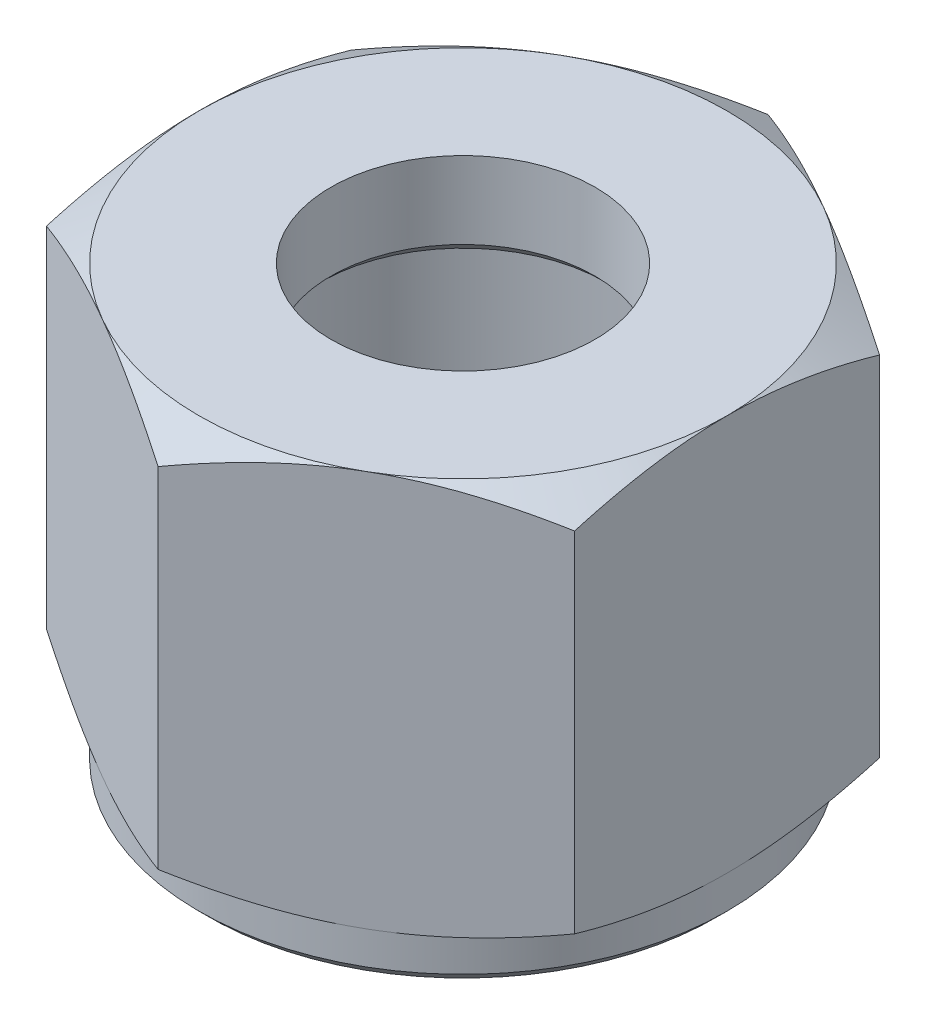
ISO-10303-21;
HEADER;
FILE_DESCRIPTION(('STEP AP214'),'2;1');
FILE_NAME('part.step','',(''),(''),'','','');
FILE_SCHEMA(('AUTOMOTIVE_DESIGN { 1 0 10303 214 1 1 1 1 }'));
ENDSEC;
DATA;
#1=APPLICATION_CONTEXT('core data for automotive mechanical design processes');
#2=APPLICATION_PROTOCOL_DEFINITION('international standard','automotive_design',2000,#1);
#3=PRODUCT_CONTEXT('',#1,'mechanical');
#4=PRODUCT('Part','Part','',(#3));
#5=PRODUCT_RELATED_PRODUCT_CATEGORY('part','',(#4));
#6=PRODUCT_DEFINITION_FORMATION('','',#4);
#7=PRODUCT_DEFINITION_CONTEXT('part definition',#1,'design');
#8=PRODUCT_DEFINITION('design','',#6,#7);
#9=PRODUCT_DEFINITION_SHAPE('','',#8);
#10=(LENGTH_UNIT() NAMED_UNIT(*) SI_UNIT(.MILLI.,.METRE.));
#11=(NAMED_UNIT(*) PLANE_ANGLE_UNIT() SI_UNIT($,.RADIAN.));
#12=(NAMED_UNIT(*) SI_UNIT($,.STERADIAN.) SOLID_ANGLE_UNIT());
#13=UNCERTAINTY_MEASURE_WITH_UNIT(LENGTH_MEASURE(1.E-05),#10,'distance_accuracy_value','');
#14=(GEOMETRIC_REPRESENTATION_CONTEXT(3) GLOBAL_UNCERTAINTY_ASSIGNED_CONTEXT((#13)) GLOBAL_UNIT_ASSIGNED_CONTEXT((#10,
#11,#12)) REPRESENTATION_CONTEXT('',''));
#15=CARTESIAN_POINT('',(0.,0.,0.));
#16=DIRECTION('',(0.,0.,1.));
#17=DIRECTION('',(1.,0.,0.));
#18=AXIS2_PLACEMENT_3D('',#15,#16,#17);
#19=CARTESIAN_POINT('',(12.,18.,-6.92820323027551));
#20=DIRECTION('',(-0.5,0.,0.866025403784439));
#21=DIRECTION('',(0.866025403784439,0.,0.5));
#22=AXIS2_PLACEMENT_3D('',#19,#20,#21);
#23=PLANE('',#22);
#24=CARTESIAN_POINT('',(-0.000199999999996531,1.07186343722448,-13.8565219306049));
#25=CARTESIAN_POINT('',(0.263585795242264,0.983949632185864,-13.7042251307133));
#26=CARTESIAN_POINT('',(0.528355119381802,0.90002599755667,-13.5513604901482));
#27=CARTESIAN_POINT('',(1.06001701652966,0.741266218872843,-13.244405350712));
#28=CARTESIAN_POINT('',(1.32691025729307,0.666433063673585,-13.0903144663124));
#29=CARTESIAN_POINT('',(2.13189040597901,0.457017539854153,-12.6255589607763));
#30=CARTESIAN_POINT('',(2.67315507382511,0.337903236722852,-12.3130596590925));
#31=CARTESIAN_POINT('',(3.483132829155,0.198231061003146,-11.8454187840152));
#32=CARTESIAN_POINT('',(3.74942610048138,0.158443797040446,-11.6916742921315));
#33=CARTESIAN_POINT('',(4.28324559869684,0.0917233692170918,-11.3834734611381));
#34=CARTESIAN_POINT('',(4.55077184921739,0.0647904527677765,-11.2290171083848));
#35=CARTESIAN_POINT('',(5.08627036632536,0.0244685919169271,-10.9198468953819));
#36=CARTESIAN_POINT('',(5.35424172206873,0.0110635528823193,-10.7651335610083));
#37=CARTESIAN_POINT('',(5.89043273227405,-0.00191690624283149,-10.4555635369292));
#38=CARTESIAN_POINT('',(6.15865237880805,-0.00149275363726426,-10.3007068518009));
#39=CARTESIAN_POINT('',(6.66008937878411,0.0122200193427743,-10.0112020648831));
#40=CARTESIAN_POINT('',(6.89334249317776,0.0238359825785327,-9.87653331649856));
#41=CARTESIAN_POINT('',(7.35931224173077,0.0573080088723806,-9.60750555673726));
#42=CARTESIAN_POINT('',(7.59202883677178,0.079164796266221,-9.47314656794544));
#43=CARTESIAN_POINT('',(8.05679907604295,0.132737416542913,-9.2048113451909));
#44=CARTESIAN_POINT('',(8.28885201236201,0.164461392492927,-9.07083551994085));
#45=CARTESIAN_POINT('',(8.75186996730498,0.237211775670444,-8.80351197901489));
#46=CARTESIAN_POINT('',(8.98283491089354,0.278238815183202,-8.67016430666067));
#47=CARTESIAN_POINT('',(9.68394195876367,0.416311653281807,-8.26537996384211));
#48=CARTESIAN_POINT('',(10.1520537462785,0.52712488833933,-7.99511549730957));
#49=CARTESIAN_POINT('',(11.0812971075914,0.778625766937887,-7.45861659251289));
#50=CARTESIAN_POINT('',(11.5424405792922,0.919254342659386,-7.19237528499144));
#51=CARTESIAN_POINT('',(12.0002,1.07186343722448,-6.92808776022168));
#52=B_SPLINE_CURVE_WITH_KNOTS('',3,(#24,#25,#26,#27,#28,#29,#30,#31,#32,#33,#34,#35,#36,#37,#38,
#39,#40,#41,#42,#43,#44,#45,#46,#47,#48,#49,#50,#51),.UNSPECIFIED.,.F.,.F.,(4,2,2,2,2,2,2,2,2,2,
2,2,2,4),(0.,0.951004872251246,1.90232158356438,3.80900466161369,4.73894551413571,
5.6689042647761,6.59775529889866,7.52657763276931,8.33514643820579,9.1437724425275,
9.95306755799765,10.7624176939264,12.4167102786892,14.0677556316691),.UNSPECIFIED.);
#53=CARTESIAN_POINT('',(0.,1.07179676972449,-13.856406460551));
#54=VERTEX_POINT('',#53);
#55=CARTESIAN_POINT('',(6.,0.,-10.3923048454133));
#56=VERTEX_POINT('',#55);
#57=EDGE_CURVE('E140',#54,#56,#52,.T.);
#58=ORIENTED_EDGE('',*,*,#57,.F.);
#59=DIRECTION('',(0.,-1.,0.));
#60=VECTOR('',#59,1.);
#61=CARTESIAN_POINT('',(0.,18.,-13.856406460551));
#62=LINE('',#61,#60);
#63=CARTESIAN_POINT('',(0.,16.9282032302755,-13.856406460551));
#64=VERTEX_POINT('',#63);
#65=EDGE_CURVE('E296',#64,#54,#62,.T.);
#66=ORIENTED_EDGE('',*,*,#65,.F.);
#67=CARTESIAN_POINT('',(12.0002,16.9281365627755,-6.92808776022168));
#68=CARTESIAN_POINT('',(11.7364142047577,17.0160503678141,-7.0803845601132));
#69=CARTESIAN_POINT('',(11.4716448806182,17.0999740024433,-7.23324920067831));
#70=CARTESIAN_POINT('',(10.9399829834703,17.2587337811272,-7.5402043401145));
#71=CARTESIAN_POINT('',(10.6730897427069,17.3335669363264,-7.69429522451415));
#72=CARTESIAN_POINT('',(9.86810959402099,17.5429824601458,-8.15905073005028));
#73=CARTESIAN_POINT('',(9.3268449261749,17.6620967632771,-8.47155003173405));
#74=CARTESIAN_POINT('',(8.51686717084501,17.8017689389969,-8.93919090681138));
#75=CARTESIAN_POINT('',(8.25057389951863,17.8415562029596,-9.09293539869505));
#76=CARTESIAN_POINT('',(7.71675440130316,17.9082766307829,-9.40113622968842));
#77=CARTESIAN_POINT('',(7.44922815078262,17.9352095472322,-9.55559258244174));
#78=CARTESIAN_POINT('',(6.91372963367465,17.9755314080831,-9.86476279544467));
#79=CARTESIAN_POINT('',(6.64575827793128,17.9889364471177,-10.0194761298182));
#80=CARTESIAN_POINT('',(6.10956726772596,18.0019169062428,-10.3290461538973));
#81=CARTESIAN_POINT('',(5.84134762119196,18.0014927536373,-10.4839028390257));
#82=CARTESIAN_POINT('',(5.3399106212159,17.9877799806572,-10.7734076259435));
#83=CARTESIAN_POINT('',(5.10665750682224,17.9761640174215,-10.908076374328));
#84=CARTESIAN_POINT('',(4.64068775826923,17.9426919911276,-11.1771041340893));
#85=CARTESIAN_POINT('',(4.40797116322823,17.9208352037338,-11.3114631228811));
#86=CARTESIAN_POINT('',(3.94320092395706,17.8672625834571,-11.5797983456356));
#87=CARTESIAN_POINT('',(3.711147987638,17.8355386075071,-11.7137741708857));
#88=CARTESIAN_POINT('',(3.24813003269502,17.7627882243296,-11.9810977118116));
#89=CARTESIAN_POINT('',(3.01716508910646,17.7217611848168,-12.1144453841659));
#90=CARTESIAN_POINT('',(2.31605804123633,17.5836883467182,-12.5192297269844));
#91=CARTESIAN_POINT('',(1.84794625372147,17.4728751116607,-12.789494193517));
#92=CARTESIAN_POINT('',(0.918702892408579,17.2213742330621,-13.3259930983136));
#93=CARTESIAN_POINT('',(0.457559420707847,17.0807456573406,-13.5922344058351));
#94=CARTESIAN_POINT('',(-0.000199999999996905,16.9281365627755,-13.8565219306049));
#95=B_SPLINE_CURVE_WITH_KNOTS('',3,(#67,#68,#69,#70,#71,#72,#73,#74,#75,#76,#77,#78,#79,#80,#81,
#82,#83,#84,#85,#86,#87,#88,#89,#90,#91,#92,#93,#94),.UNSPECIFIED.,.F.,.F.,(4,2,2,2,2,2,2,2,2,2,
2,2,2,4),(0.,0.951004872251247,1.90232158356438,3.80900466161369,4.7389455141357,
5.66890426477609,6.59775529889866,7.5265776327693,8.33514643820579,9.1437724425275,
9.95306755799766,10.7624176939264,12.4167102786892,14.0677556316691),.UNSPECIFIED.);
#96=CARTESIAN_POINT('',(6.,18.,-10.3923048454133));
#97=VERTEX_POINT('',#96);
#98=EDGE_CURVE('E571',#97,#64,#95,.T.);
#99=ORIENTED_EDGE('',*,*,#98,.F.);
#100=CARTESIAN_POINT('',(12.,16.9282032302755,-6.92820323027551));
#101=VERTEX_POINT('',#100);
#102=EDGE_CURVE('E568',#101,#97,#95,.T.);
#103=ORIENTED_EDGE('',*,*,#102,.F.);
#104=DIRECTION('',(0.,-1.,0.));
#105=VECTOR('',#104,1.);
#106=CARTESIAN_POINT('',(12.,18.,-6.92820323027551));
#107=LINE('',#106,#105);
#108=CARTESIAN_POINT('',(12.,1.07179676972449,-6.92820323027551));
#109=VERTEX_POINT('',#108);
#110=EDGE_CURVE('E162',#101,#109,#107,.T.);
#111=ORIENTED_EDGE('',*,*,#110,.T.);
#112=EDGE_CURVE('E148',#56,#109,#52,.T.);
#113=ORIENTED_EDGE('',*,*,#112,.F.);
#114=EDGE_LOOP('',(#58,#66,#99,#103,#111,#113));
#115=FACE_BOUND('',#114,.T.);
#116=ADVANCED_FACE('F38',(#115),#23,.F.);
#117=CARTESIAN_POINT('',(0.,18.,-13.856406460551));
#118=DIRECTION('',(0.5,0.,0.866025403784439));
#119=DIRECTION('',(0.866025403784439,0.,-0.5));
#120=AXIS2_PLACEMENT_3D('',#117,#118,#119);
#121=PLANE('',#120);
#122=CARTESIAN_POINT('',(-12.0002,1.07186343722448,-6.92808776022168));
#123=CARTESIAN_POINT('',(-11.7364142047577,0.983949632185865,-7.0803845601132));
#124=CARTESIAN_POINT('',(-11.4716448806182,0.900025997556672,-7.23324920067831));
#125=CARTESIAN_POINT('',(-10.9399829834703,0.741266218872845,-7.5402043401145));
#126=CARTESIAN_POINT('',(-10.6730897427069,0.666433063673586,-7.69429522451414));
#127=CARTESIAN_POINT('',(-9.868109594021,0.457017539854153,-8.15905073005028));
#128=CARTESIAN_POINT('',(-9.3268449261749,0.337903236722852,-8.47155003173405));
#129=CARTESIAN_POINT('',(-8.51686717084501,0.198231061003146,-8.93919090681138));
#130=CARTESIAN_POINT('',(-8.25057389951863,0.158443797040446,-9.09293539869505));
#131=CARTESIAN_POINT('',(-7.71675440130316,0.0917233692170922,-9.40113622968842));
#132=CARTESIAN_POINT('',(-7.44922815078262,0.0647904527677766,-9.55559258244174));
#133=CARTESIAN_POINT('',(-6.91372963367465,0.024468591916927,-9.86476279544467));
#134=CARTESIAN_POINT('',(-6.64575827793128,0.0110635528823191,-10.0194761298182));
#135=CARTESIAN_POINT('',(-6.10956726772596,-0.00191690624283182,-10.3290461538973));
#136=CARTESIAN_POINT('',(-5.84134762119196,-0.00149275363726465,-10.4839028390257));
#137=CARTESIAN_POINT('',(-5.3399106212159,0.0122200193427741,-10.7734076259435));
#138=CARTESIAN_POINT('',(-5.10665750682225,0.0238359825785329,-10.908076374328));
#139=CARTESIAN_POINT('',(-4.64068775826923,0.0573080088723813,-11.1771041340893));
#140=CARTESIAN_POINT('',(-4.40797116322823,0.0791647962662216,-11.3114631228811));
#141=CARTESIAN_POINT('',(-3.94320092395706,0.132737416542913,-11.5797983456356));
#142=CARTESIAN_POINT('',(-3.711147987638,0.164461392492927,-11.7137741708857));
#143=CARTESIAN_POINT('',(-3.24813003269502,0.237211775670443,-11.9810977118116));
#144=CARTESIAN_POINT('',(-3.01716508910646,0.278238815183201,-12.1144453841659));
#145=CARTESIAN_POINT('',(-2.31605804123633,0.416311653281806,-12.5192297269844));
#146=CARTESIAN_POINT('',(-1.84794625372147,0.52712488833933,-12.789494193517));
#147=CARTESIAN_POINT('',(-0.918702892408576,0.778625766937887,-13.3259930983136));
#148=CARTESIAN_POINT('',(-0.457559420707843,0.919254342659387,-13.5922344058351));
#149=CARTESIAN_POINT('',(0.000200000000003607,1.07186343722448,-13.8565219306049));
#150=B_SPLINE_CURVE_WITH_KNOTS('',3,(#122,#123,#124,#125,#126,#127,#128,#129,#130,#131,#132,
#133,#134,#135,#136,#137,#138,#139,#140,#141,#142,#143,#144,#145,#146,#147,#148,#149),
.UNSPECIFIED.,.F.,.F.,(4,2,2,2,2,2,2,2,2,2,2,2,2,4),(0.,0.951004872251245,1.90232158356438,
3.80900466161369,4.73894551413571,5.6689042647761,6.59775529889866,7.52657763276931,
8.3351464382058,9.1437724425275,9.95306755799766,10.7624176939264,12.4167102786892,
14.0677556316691),.UNSPECIFIED.);
#151=CARTESIAN_POINT('',(-12.,1.07179676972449,-6.92820323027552));
#152=VERTEX_POINT('',#151);
#153=CARTESIAN_POINT('',(-6.,0.,-10.3923048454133));
#154=VERTEX_POINT('',#153);
#155=EDGE_CURVE('E272',#152,#154,#150,.T.);
#156=ORIENTED_EDGE('',*,*,#155,.F.);
#157=DIRECTION('',(0.,-1.,0.));
#158=VECTOR('',#157,1.);
#159=CARTESIAN_POINT('',(-12.,18.,-6.92820323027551));
#160=LINE('',#159,#158);
#161=CARTESIAN_POINT('',(-12.,16.9282032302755,-6.92820323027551));
#162=VERTEX_POINT('',#161);
#163=EDGE_CURVE('E292',#162,#152,#160,.T.);
#164=ORIENTED_EDGE('',*,*,#163,.F.);
#165=CARTESIAN_POINT('',(0.000200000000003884,16.9281365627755,-13.8565219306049));
#166=CARTESIAN_POINT('',(-0.263585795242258,17.0160503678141,-13.7042251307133));
#167=CARTESIAN_POINT('',(-0.528355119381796,17.0999740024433,-13.5513604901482));
#168=CARTESIAN_POINT('',(-1.06001701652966,17.2587337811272,-13.244405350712));
#169=CARTESIAN_POINT('',(-1.32691025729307,17.3335669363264,-13.0903144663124));
#170=CARTESIAN_POINT('',(-2.13189040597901,17.5429824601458,-12.6255589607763));
#171=CARTESIAN_POINT('',(-2.6731550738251,17.6620967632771,-12.3130596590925));
#172=CARTESIAN_POINT('',(-3.483132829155,17.8017689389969,-11.8454187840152));
#173=CARTESIAN_POINT('',(-3.74942610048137,17.8415562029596,-11.6916742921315));
#174=CARTESIAN_POINT('',(-4.28324559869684,17.9082766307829,-11.3834734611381));
#175=CARTESIAN_POINT('',(-4.55077184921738,17.9352095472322,-11.2290171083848));
#176=CARTESIAN_POINT('',(-5.08627036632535,17.9755314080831,-10.9198468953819));
#177=CARTESIAN_POINT('',(-5.35424172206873,17.9889364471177,-10.7651335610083));
#178=CARTESIAN_POINT('',(-5.89043273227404,18.0019169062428,-10.4555635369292));
#179=CARTESIAN_POINT('',(-6.15865237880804,18.0014927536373,-10.3007068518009));
#180=CARTESIAN_POINT('',(-6.66008937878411,17.9877799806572,-10.0112020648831));
#181=CARTESIAN_POINT('',(-6.89334249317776,17.9761640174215,-9.87653331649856));
#182=CARTESIAN_POINT('',(-7.35931224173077,17.9426919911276,-9.60750555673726));
#183=CARTESIAN_POINT('',(-7.59202883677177,17.9208352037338,-9.47314656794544));
#184=CARTESIAN_POINT('',(-8.05679907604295,17.8672625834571,-9.2048113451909));
#185=CARTESIAN_POINT('',(-8.28885201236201,17.8355386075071,-9.07083551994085));
#186=CARTESIAN_POINT('',(-8.75186996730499,17.7627882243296,-8.80351197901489));
#187=CARTESIAN_POINT('',(-8.98283491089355,17.7217611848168,-8.67016430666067));
#188=CARTESIAN_POINT('',(-9.68394195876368,17.5836883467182,-8.26537996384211));
#189=CARTESIAN_POINT('',(-10.1520537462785,17.4728751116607,-7.99511549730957));
#190=CARTESIAN_POINT('',(-11.0812971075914,17.2213742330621,-7.45861659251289));
#191=CARTESIAN_POINT('',(-11.5424405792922,17.0807456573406,-7.19237528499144));
#192=CARTESIAN_POINT('',(-12.0002,16.9281365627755,-6.92808776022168));
#193=B_SPLINE_CURVE_WITH_KNOTS('',3,(#165,#166,#167,#168,#169,#170,#171,#172,#173,#174,#175,
#176,#177,#178,#179,#180,#181,#182,#183,#184,#185,#186,#187,#188,#189,#190,#191,#192),
.UNSPECIFIED.,.F.,.F.,(4,2,2,2,2,2,2,2,2,2,2,2,2,4),(0.,0.951004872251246,1.90232158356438,
3.80900466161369,4.73894551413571,5.6689042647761,6.59775529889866,7.52657763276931,
8.33514643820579,9.1437724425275,9.95306755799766,10.7624176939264,12.4167102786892,
14.0677556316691),.UNSPECIFIED.);
#194=CARTESIAN_POINT('',(-6.,18.,-10.3923048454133));
#195=VERTEX_POINT('',#194);
#196=EDGE_CURVE('E264',#195,#162,#193,.T.);
#197=ORIENTED_EDGE('',*,*,#196,.F.);
#198=EDGE_CURVE('E573',#64,#195,#193,.T.);
#199=ORIENTED_EDGE('',*,*,#198,.F.);
#200=ORIENTED_EDGE('',*,*,#65,.T.);
#201=EDGE_CURVE('E142',#154,#54,#150,.T.);
#202=ORIENTED_EDGE('',*,*,#201,.F.);
#203=EDGE_LOOP('',(#156,#164,#197,#199,#200,#202));
#204=FACE_BOUND('',#203,.T.);
#205=ADVANCED_FACE('F257',(#204),#121,.F.);
#206=CARTESIAN_POINT('',(-12.,18.,-6.92820323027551));
#207=DIRECTION('',(1.,0.,0.));
#208=DIRECTION('',(0.,0.,-1.));
#209=AXIS2_PLACEMENT_3D('',#206,#207,#208);
#210=PLANE('',#209);
#211=CARTESIAN_POINT('',(-12.,5.93015605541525,-18.761988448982));
#212=CARTESIAN_POINT('',(-12.,5.8023370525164,-18.4991845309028));
#213=CARTESIAN_POINT('',(-12.,5.67514427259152,-18.2360761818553));
#214=CARTESIAN_POINT('',(-12.,5.42215275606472,-17.7091871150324));
#215=CARTESIAN_POINT('',(-12.,5.2963540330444,-17.4454063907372));
#216=CARTESIAN_POINT('',(-12.,4.92122909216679,-16.6528920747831));
#217=CARTESIAN_POINT('',(-12.,4.67421096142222,-16.123061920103));
#218=CARTESIAN_POINT('',(-12.,4.18649967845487,-15.0570957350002));
#219=CARTESIAN_POINT('',(-12.,3.94584694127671,-14.5209411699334));
#220=CARTESIAN_POINT('',(-12.,3.47419167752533,-13.4444185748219));
#221=CARTESIAN_POINT('',(-12.,3.24318870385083,-12.9040507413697));
#222=CARTESIAN_POINT('',(-12.,2.78610353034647,-11.8006693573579));
#223=CARTESIAN_POINT('',(-12.,2.56042239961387,-11.2374888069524));
#224=CARTESIAN_POINT('',(-12.,2.12577473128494,-10.1045927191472));
#225=CARTESIAN_POINT('',(-12.,1.91681004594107,-9.534876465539));
#226=CARTESIAN_POINT('',(-12.,1.52096994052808,-8.38903647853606));
#227=CARTESIAN_POINT('',(-12.,1.33405120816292,-7.8129278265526));
#228=CARTESIAN_POINT('',(-12.,0.988186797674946,-6.65239659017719));
#229=CARTESIAN_POINT('',(-12.,0.829232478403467,-6.06797663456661));
#230=CARTESIAN_POINT('',(-12.,0.617856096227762,-5.18651066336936));
#231=CARTESIAN_POINT('',(-12.,0.552043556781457,-4.89265724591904));
#232=CARTESIAN_POINT('',(-12.,0.430221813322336,-4.30291479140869));
#233=CARTESIAN_POINT('',(-12.,0.374212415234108,-4.00702579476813));
#234=CARTESIAN_POINT('',(-12.,0.272976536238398,-3.41340813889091));
#235=CARTESIAN_POINT('',(-12.,0.227749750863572,-3.11567953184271));
#236=CARTESIAN_POINT('',(-12.,0.148974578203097,-2.51868256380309));
#237=CARTESIAN_POINT('',(-12.,0.115425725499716,-2.21941426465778));
#238=CARTESIAN_POINT('',(-12.,0.061102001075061,-1.62372788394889));
#239=CARTESIAN_POINT('',(-12.,0.0401631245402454,-1.32732485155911));
#240=CARTESIAN_POINT('',(-12.,0.0108462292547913,-0.733899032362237));
#241=CARTESIAN_POINT('',(-12.,0.00246799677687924,-0.436876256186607));
#242=CARTESIAN_POINT('',(-12.,-0.00152763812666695,0.157264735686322));
#243=CARTESIAN_POINT('',(-12.,0.00285526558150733,0.454382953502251));
#244=CARTESIAN_POINT('',(-12.,0.0242735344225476,1.04816621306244));
#245=CARTESIAN_POINT('',(-12.,0.0413094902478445,1.34483123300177));
#246=CARTESIAN_POINT('',(-12.,0.0967062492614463,2.05290252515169));
#247=CARTESIAN_POINT('',(-12.,0.140797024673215,2.46387036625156));
#248=CARTESIAN_POINT('',(-12.,0.250891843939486,3.28283839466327));
#249=CARTESIAN_POINT('',(-12.,0.316898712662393,3.69083819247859));
#250=CARTESIAN_POINT('',(-12.,0.544298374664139,4.90983684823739));
#251=CARTESIAN_POINT('',(-12.,0.735035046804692,5.71543863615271));
#252=CARTESIAN_POINT('',(-12.,1.06700971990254,6.92092838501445));
#253=CARTESIAN_POINT('',(-12.,1.18700530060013,7.32702513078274));
#254=CARTESIAN_POINT('',(-12.,1.43973785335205,8.13527300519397));
#255=CARTESIAN_POINT('',(-12.,1.57247493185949,8.53742410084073));
#256=CARTESIAN_POINT('',(-12.,1.8485399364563,9.33791822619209));
#257=CARTESIAN_POINT('',(-12.,1.9918649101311,9.73626228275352));
#258=CARTESIAN_POINT('',(-12.,2.21350430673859,10.3312808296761));
#259=CARTESIAN_POINT('',(-12.,2.28849198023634,10.5292021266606));
#260=CARTESIAN_POINT('',(-12.,2.44050041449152,10.9242626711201));
#261=CARTESIAN_POINT('',(-12.,2.5175211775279,11.1214019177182));
#262=CARTESIAN_POINT('',(-12.,2.75201451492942,11.7133501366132));
#263=CARTESIAN_POINT('',(-12.,2.91230253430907,12.1070454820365));
#264=CARTESIAN_POINT('',(-12.,3.23915362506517,12.8918284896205));
#265=CARTESIAN_POINT('',(-12.,3.40571691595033,13.2829160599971));
#266=CARTESIAN_POINT('',(-12.,3.74414891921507,14.0628409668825));
#267=CARTESIAN_POINT('',(-12.,3.916018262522,14.4516780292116));
#268=CARTESIAN_POINT('',(-12.,4.26424280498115,15.2273406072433));
#269=CARTESIAN_POINT('',(-12.,4.44059806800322,15.614166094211));
#270=CARTESIAN_POINT('',(-12.,4.97554471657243,16.7723918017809));
#271=CARTESIAN_POINT('',(-12.,5.33984760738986,17.541154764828));
#272=CARTESIAN_POINT('',(-12.,6.07962873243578,19.0731969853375));
#273=CARTESIAN_POINT('',(-12.,6.45510628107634,19.8364765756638));
#274=CARTESIAN_POINT('',(-12.,7.21528477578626,21.3602920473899));
#275=CARTESIAN_POINT('',(-12.,7.60000237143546,22.1208196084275));
#276=CARTESIAN_POINT('',(-12.,8.37599901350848,23.6385255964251));
#277=CARTESIAN_POINT('',(-12.,8.76727814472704,24.3957039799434));
#278=CARTESIAN_POINT('',(-12.,9.55486583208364,25.9071520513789));
#279=CARTESIAN_POINT('',(-12.,9.95117286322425,26.6614225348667));
#280=CARTESIAN_POINT('',(-12.,10.7478929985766,28.1677850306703));
#281=CARTESIAN_POINT('',(-12.,11.1483060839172,28.9198770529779));
#282=CARTESIAN_POINT('',(-12.,12.2541451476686,30.9859910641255));
#283=CARTESIAN_POINT('',(-12.,12.9629824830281,32.2981866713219));
#284=CARTESIAN_POINT('',(-12.,14.3878944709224,34.9187800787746));
#285=CARTESIAN_POINT('',(-12.,15.1039697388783,36.2271775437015));
#286=CARTESIAN_POINT('',(-12.,16.5386827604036,38.8360831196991));
#287=CARTESIAN_POINT('',(-12.,17.2573003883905,40.1366023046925));
#288=CARTESIAN_POINT('',(-12.,18.3381788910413,42.0856582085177));
#289=CARTESIAN_POINT('',(-12.,18.6989458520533,42.7350243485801));
#290=CARTESIAN_POINT('',(-12.,19.4213608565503,44.0332655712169));
#291=CARTESIAN_POINT('',(-12.,19.7830088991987,44.6821406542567));
#292=CARTESIAN_POINT('',(-12.,20.1450405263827,45.3308016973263));
#293=B_SPLINE_CURVE_WITH_KNOTS('',3,(#211,#212,#213,#214,#215,#216,#217,#218,#219,#220,#221,
#222,#223,#224,#225,#226,#227,#228,#229,#230,#231,#232,#233,#234,#235,#236,#237,#238,#239,#240,
#241,#242,#243,#244,#245,#246,#247,#248,#249,#250,#251,#252,#253,#254,#255,#256,#257,#258,#259,
#260,#261,#262,#263,#264,#265,#266,#267,#268,#269,#270,#271,#272,#273,#274,#275,#276,#277,#278,
#279,#280,#281,#282,#283,#284,#285,#286,#287,#288,#289,#290,#291,#292),.UNSPECIFIED.,.F.,.F.,(4,
2,2,2,2,2,2,2,2,2,2,2,2,2,2,2,2,2,2,2,2,2,2,2,2,2,2,2,2,2,2,2,2,2,2,2,2,2,2,2,4),(0.,
0.876715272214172,1.75343907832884,3.50713894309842,5.27012437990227,7.03302804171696,
8.85297337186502,10.6731200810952,12.489629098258,14.3055758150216,15.2088379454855,
16.1120821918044,17.0153009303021,17.9184836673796,18.8096506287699,19.7008024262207,
20.5919756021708,21.4831903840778,22.7224730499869,23.9619155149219,26.4419887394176,
27.7122404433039,28.9825027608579,30.2524121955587,30.8873542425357,31.5222970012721,
32.7974483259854,34.0726442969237,35.347992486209,36.6233588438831,39.1753572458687,
41.7271993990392,44.2840478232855,46.8409293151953,49.3970529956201,51.9531649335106,
56.4273629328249,60.9019446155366,65.3594960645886,67.5880517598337,69.8166053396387),.UNSPECIFIED.);
#294=CARTESIAN_POINT('',(-12.,1.07179676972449,6.92820323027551));
#295=VERTEX_POINT('',#294);
#296=CARTESIAN_POINT('',(-12.,0.,0.));
#297=VERTEX_POINT('',#296);
#298=EDGE_CURVE('E282',#295,#297,#293,.F.);
#299=ORIENTED_EDGE('',*,*,#298,.F.);
#300=DIRECTION('',(0.,-1.,0.));
#301=VECTOR('',#300,1.);
#302=CARTESIAN_POINT('',(-12.,18.,6.92820323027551));
#303=LINE('',#302,#301);
#304=CARTESIAN_POINT('',(-12.,16.9282032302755,6.92820323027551));
#305=VERTEX_POINT('',#304);
#306=EDGE_CURVE('E297',#305,#295,#303,.T.);
#307=ORIENTED_EDGE('',*,*,#306,.F.);
#308=CARTESIAN_POINT('',(-12.,12.0698439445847,-18.761988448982));
#309=CARTESIAN_POINT('',(-12.,12.1976629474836,-18.4991845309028));
#310=CARTESIAN_POINT('',(-12.,12.3248557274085,-18.2360761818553));
#311=CARTESIAN_POINT('',(-12.,12.5778472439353,-17.7091871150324));
#312=CARTESIAN_POINT('',(-12.,12.7036459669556,-17.4454063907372));
#313=CARTESIAN_POINT('',(-12.,13.0787709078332,-16.6528920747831));
#314=CARTESIAN_POINT('',(-12.,13.3257890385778,-16.123061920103));
#315=CARTESIAN_POINT('',(-12.,13.8135003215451,-15.0570957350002));
#316=CARTESIAN_POINT('',(-12.,14.0541530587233,-14.5209411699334));
#317=CARTESIAN_POINT('',(-12.,14.5258083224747,-13.4444185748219));
#318=CARTESIAN_POINT('',(-12.,14.7568112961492,-12.9040507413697));
#319=CARTESIAN_POINT('',(-12.,15.2138964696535,-11.8006693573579));
#320=CARTESIAN_POINT('',(-12.,15.4395776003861,-11.2374888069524));
#321=CARTESIAN_POINT('',(-12.,15.8742252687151,-10.1045927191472));
#322=CARTESIAN_POINT('',(-12.,16.0831899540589,-9.534876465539));
#323=CARTESIAN_POINT('',(-12.,16.4790300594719,-8.38903647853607));
#324=CARTESIAN_POINT('',(-12.,16.6659487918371,-7.81292782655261));
#325=CARTESIAN_POINT('',(-12.,17.0118132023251,-6.6523965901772));
#326=CARTESIAN_POINT('',(-12.,17.1707675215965,-6.06797663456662));
#327=CARTESIAN_POINT('',(-12.,17.3821439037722,-5.18651066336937));
#328=CARTESIAN_POINT('',(-12.,17.4479564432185,-4.89265724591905));
#329=CARTESIAN_POINT('',(-12.,17.5697781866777,-4.3029147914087));
#330=CARTESIAN_POINT('',(-12.,17.6257875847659,-4.00702579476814));
#331=CARTESIAN_POINT('',(-12.,17.7270234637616,-3.41340813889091));
#332=CARTESIAN_POINT('',(-12.,17.7722502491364,-3.11567953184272));
#333=CARTESIAN_POINT('',(-12.,17.8510254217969,-2.5186825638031));
#334=CARTESIAN_POINT('',(-12.,17.8845742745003,-2.21941426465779));
#335=CARTESIAN_POINT('',(-12.,17.9388979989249,-1.6237278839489));
#336=CARTESIAN_POINT('',(-12.,17.9598368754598,-1.32732485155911));
#337=CARTESIAN_POINT('',(-12.,17.9891537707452,-0.733899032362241));
#338=CARTESIAN_POINT('',(-12.,17.9975320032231,-0.436876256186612));
#339=CARTESIAN_POINT('',(-12.,18.0015276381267,0.157264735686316));
#340=CARTESIAN_POINT('',(-12.,17.9971447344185,0.454382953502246));
#341=CARTESIAN_POINT('',(-12.,17.9757264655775,1.04816621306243));
#342=CARTESIAN_POINT('',(-12.,17.9586905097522,1.34483123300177));
#343=CARTESIAN_POINT('',(-12.,17.9032937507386,2.05290252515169));
#344=CARTESIAN_POINT('',(-12.,17.8592029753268,2.46387036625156));
#345=CARTESIAN_POINT('',(-12.,17.7491081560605,3.28283839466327));
#346=CARTESIAN_POINT('',(-12.,17.6831012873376,3.69083819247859));
#347=CARTESIAN_POINT('',(-12.,17.4557016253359,4.90983684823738));
#348=CARTESIAN_POINT('',(-12.,17.2649649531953,5.71543863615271));
#349=CARTESIAN_POINT('',(-12.,16.9329902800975,6.92092838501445));
#350=CARTESIAN_POINT('',(-12.,16.8129946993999,7.32702513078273));
#351=CARTESIAN_POINT('',(-12.,16.560262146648,8.13527300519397));
#352=CARTESIAN_POINT('',(-12.,16.4275250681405,8.53742410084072));
#353=CARTESIAN_POINT('',(-12.,16.1514600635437,9.33791822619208));
#354=CARTESIAN_POINT('',(-12.,16.0081350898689,9.73626228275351));
#355=CARTESIAN_POINT('',(-12.,15.7864956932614,10.3312808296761));
#356=CARTESIAN_POINT('',(-12.,15.7115080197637,10.5292021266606));
#357=CARTESIAN_POINT('',(-12.,15.5594995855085,10.9242626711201));
#358=CARTESIAN_POINT('',(-12.,15.4824788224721,11.1214019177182));
#359=CARTESIAN_POINT('',(-12.,15.2479854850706,11.7133501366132));
#360=CARTESIAN_POINT('',(-12.,15.0876974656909,12.1070454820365));
#361=CARTESIAN_POINT('',(-12.,14.7608463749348,12.8918284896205));
#362=CARTESIAN_POINT('',(-12.,14.5942830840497,13.2829160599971));
#363=CARTESIAN_POINT('',(-12.,14.2558510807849,14.0628409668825));
#364=CARTESIAN_POINT('',(-12.,14.083981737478,14.4516780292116));
#365=CARTESIAN_POINT('',(-12.,13.7357571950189,15.2273406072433));
#366=CARTESIAN_POINT('',(-12.,13.5594019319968,15.6141660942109));
#367=CARTESIAN_POINT('',(-12.,13.0244552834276,16.7723918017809));
#368=CARTESIAN_POINT('',(-12.,12.6601523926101,17.541154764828));
#369=CARTESIAN_POINT('',(-12.,11.9203712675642,19.0731969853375));
#370=CARTESIAN_POINT('',(-12.,11.5448937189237,19.8364765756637));
#371=CARTESIAN_POINT('',(-12.,10.7847152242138,21.3602920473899));
#372=CARTESIAN_POINT('',(-12.,10.3999976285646,22.1208196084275));
#373=CARTESIAN_POINT('',(-12.,9.62400098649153,23.638525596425));
#374=CARTESIAN_POINT('',(-12.,9.23272185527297,24.3957039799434));
#375=CARTESIAN_POINT('',(-12.,8.44513416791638,25.9071520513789));
#376=CARTESIAN_POINT('',(-12.,8.04882713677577,26.6614225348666));
#377=CARTESIAN_POINT('',(-12.,7.25210700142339,28.1677850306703));
#378=CARTESIAN_POINT('',(-12.,6.85169391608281,28.9198770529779));
#379=CARTESIAN_POINT('',(-12.,5.74585485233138,30.9859910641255));
#380=CARTESIAN_POINT('',(-12.,5.03701751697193,32.2981866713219));
#381=CARTESIAN_POINT('',(-12.,3.61210552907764,34.9187800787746));
#382=CARTESIAN_POINT('',(-12.,2.89603026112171,36.2271775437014));
#383=CARTESIAN_POINT('',(-12.,1.46131723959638,38.8360831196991));
#384=CARTESIAN_POINT('',(-12.,0.74269961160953,40.1366023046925));
#385=CARTESIAN_POINT('',(-12.,-0.338178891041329,42.0856582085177));
#386=CARTESIAN_POINT('',(-12.,-0.69894585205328,42.7350243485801));
#387=CARTESIAN_POINT('',(-12.,-1.42136085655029,44.0332655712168));
#388=CARTESIAN_POINT('',(-12.,-1.78300889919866,44.6821406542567));
#389=CARTESIAN_POINT('',(-12.,-2.14504052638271,45.3308016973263));
#390=B_SPLINE_CURVE_WITH_KNOTS('',3,(#308,#309,#310,#311,#312,#313,#314,#315,#316,#317,#318,
#319,#320,#321,#322,#323,#324,#325,#326,#327,#328,#329,#330,#331,#332,#333,#334,#335,#336,#337,
#338,#339,#340,#341,#342,#343,#344,#345,#346,#347,#348,#349,#350,#351,#352,#353,#354,#355,#356,
#357,#358,#359,#360,#361,#362,#363,#364,#365,#366,#367,#368,#369,#370,#371,#372,#373,#374,#375,
#376,#377,#378,#379,#380,#381,#382,#383,#384,#385,#386,#387,#388,#389),.UNSPECIFIED.,.F.,.F.,(4,
2,2,2,2,2,2,2,2,2,2,2,2,2,2,2,2,2,2,2,2,2,2,2,2,2,2,2,2,2,2,2,2,2,2,2,2,2,2,2,4),(0.,
0.876715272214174,1.75343907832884,3.50713894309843,5.27012437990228,7.03302804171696,
8.85297337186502,10.6731200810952,12.489629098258,14.3055758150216,15.2088379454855,
16.1120821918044,17.0153009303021,17.9184836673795,18.8096506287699,19.7008024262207,
20.5919756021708,21.4831903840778,22.7224730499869,23.9619155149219,26.4419887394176,
27.7122404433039,28.9825027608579,30.2524121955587,30.8873542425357,31.5222970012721,
32.7974483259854,34.0726442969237,35.347992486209,36.6233588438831,39.1753572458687,
41.7271993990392,44.2840478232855,46.8409293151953,49.3970529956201,51.9531649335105,
56.4273629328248,60.9019446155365,65.3594960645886,67.5880517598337,69.8166053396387),.UNSPECIFIED.);
#391=CARTESIAN_POINT('',(-12.,18.,0.));
#392=VERTEX_POINT('',#391);
#393=EDGE_CURVE('E244',#392,#305,#390,.T.);
#394=ORIENTED_EDGE('',*,*,#393,.F.);
#395=EDGE_CURVE('E294',#162,#392,#390,.T.);
#396=ORIENTED_EDGE('',*,*,#395,.F.);
#397=ORIENTED_EDGE('',*,*,#163,.T.);
#398=EDGE_CURVE('E202',#297,#152,#293,.F.);
#399=ORIENTED_EDGE('',*,*,#398,.F.);
#400=EDGE_LOOP('',(#299,#307,#394,#396,#397,#399));
#401=FACE_BOUND('',#400,.T.);
#402=ADVANCED_FACE('F252',(#401),#210,.F.);
#403=CARTESIAN_POINT('',(-12.,18.,6.92820323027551));
#404=DIRECTION('',(0.5,0.,-0.866025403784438));
#405=DIRECTION('',(-0.866025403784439,0.,-0.5));
#406=AXIS2_PLACEMENT_3D('',#403,#404,#405);
#407=PLANE('',#406);
#408=CARTESIAN_POINT('',(0.000199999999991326,1.07186343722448,13.8565219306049));
#409=CARTESIAN_POINT('',(-0.263585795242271,0.983949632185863,13.7042251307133));
#410=CARTESIAN_POINT('',(-0.528355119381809,0.900025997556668,13.5513604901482));
#411=CARTESIAN_POINT('',(-1.06001701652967,0.741266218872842,13.244405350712));
#412=CARTESIAN_POINT('',(-1.32691025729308,0.666433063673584,13.0903144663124));
#413=CARTESIAN_POINT('',(-2.13189040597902,0.457017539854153,12.6255589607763));
#414=CARTESIAN_POINT('',(-2.67315507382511,0.337903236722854,12.3130596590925));
#415=CARTESIAN_POINT('',(-3.48313282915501,0.198231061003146,11.8454187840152));
#416=CARTESIAN_POINT('',(-3.74942610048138,0.158443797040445,11.6916742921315));
#417=CARTESIAN_POINT('',(-4.28324559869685,0.0917233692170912,11.3834734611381));
#418=CARTESIAN_POINT('',(-4.55077184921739,0.0647904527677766,11.2290171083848));
#419=CARTESIAN_POINT('',(-5.08627036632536,0.024468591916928,10.9198468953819));
#420=CARTESIAN_POINT('',(-5.35424172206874,0.0110635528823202,10.7651335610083));
#421=CARTESIAN_POINT('',(-5.89043273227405,-0.0019169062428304,10.4555635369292));
#422=CARTESIAN_POINT('',(-6.15865237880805,-0.00149275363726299,10.3007068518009));
#423=CARTESIAN_POINT('',(-6.66008937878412,0.0122200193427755,10.0112020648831));
#424=CARTESIAN_POINT('',(-6.89334249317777,0.0238359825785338,9.87653331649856));
#425=CARTESIAN_POINT('',(-7.35931224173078,0.0573080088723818,9.60750555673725));
#426=CARTESIAN_POINT('',(-7.59202883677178,0.0791647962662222,9.47314656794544));
#427=CARTESIAN_POINT('',(-8.05679907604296,0.132737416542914,9.2048113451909));
#428=CARTESIAN_POINT('',(-8.28885201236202,0.164461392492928,9.07083551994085));
#429=CARTESIAN_POINT('',(-8.75186996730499,0.237211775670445,8.80351197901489));
#430=CARTESIAN_POINT('',(-8.98283491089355,0.278238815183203,8.67016430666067));
#431=CARTESIAN_POINT('',(-9.68394195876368,0.416311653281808,8.2653799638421));
#432=CARTESIAN_POINT('',(-10.1520537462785,0.527124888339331,7.99511549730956));
#433=CARTESIAN_POINT('',(-11.0812971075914,0.77862576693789,7.45861659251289));
#434=CARTESIAN_POINT('',(-11.5424405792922,0.919254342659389,7.19237528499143));
#435=CARTESIAN_POINT('',(-12.0002,1.07186343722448,6.92808776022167));
#436=B_SPLINE_CURVE_WITH_KNOTS('',3,(#408,#409,#410,#411,#412,#413,#414,#415,#416,#417,#418,
#419,#420,#421,#422,#423,#424,#425,#426,#427,#428,#429,#430,#431,#432,#433,#434,#435),
.UNSPECIFIED.,.F.,.F.,(4,2,2,2,2,2,2,2,2,2,2,2,2,4),(0.,0.951004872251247,1.90232158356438,
3.80900466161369,4.7389455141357,5.6689042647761,6.59775529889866,7.52657763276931,
8.33514643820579,9.1437724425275,9.95306755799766,10.7624176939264,12.4167102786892,
14.0677556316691),.UNSPECIFIED.);
#437=CARTESIAN_POINT('',(0.,1.07179676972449,13.856406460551));
#438=VERTEX_POINT('',#437);
#439=CARTESIAN_POINT('',(-6.00000000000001,0.,10.3923048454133));
#440=VERTEX_POINT('',#439);
#441=EDGE_CURVE('E177',#438,#440,#436,.T.);
#442=ORIENTED_EDGE('',*,*,#441,.F.);
#443=DIRECTION('',(0.,-1.,0.));
#444=VECTOR('',#443,1.);
#445=CARTESIAN_POINT('',(0.,18.,13.856406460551));
#446=LINE('',#445,#444);
#447=CARTESIAN_POINT('',(0.,16.9282032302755,13.856406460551));
#448=VERTEX_POINT('',#447);
#449=EDGE_CURVE('E301',#448,#438,#446,.T.);
#450=ORIENTED_EDGE('',*,*,#449,.F.);
#451=CARTESIAN_POINT('',(-12.0002,16.9281365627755,6.92808776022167));
#452=CARTESIAN_POINT('',(-11.7364142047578,17.0160503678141,7.08038456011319));
#453=CARTESIAN_POINT('',(-11.4716448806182,17.0999740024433,7.23324920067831));
#454=CARTESIAN_POINT('',(-10.9399829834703,17.2587337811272,7.5402043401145));
#455=CARTESIAN_POINT('',(-10.6730897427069,17.3335669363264,7.69429522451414));
#456=CARTESIAN_POINT('',(-9.868109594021,17.5429824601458,8.15905073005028));
#457=CARTESIAN_POINT('',(-9.32684492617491,17.6620967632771,8.47155003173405));
#458=CARTESIAN_POINT('',(-8.51686717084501,17.8017689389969,8.93919090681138));
#459=CARTESIAN_POINT('',(-8.25057389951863,17.8415562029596,9.09293539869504));
#460=CARTESIAN_POINT('',(-7.71675440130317,17.9082766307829,9.40113622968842));
#461=CARTESIAN_POINT('',(-7.44922815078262,17.9352095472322,9.55559258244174));
#462=CARTESIAN_POINT('',(-6.91372963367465,17.9755314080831,9.86476279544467));
#463=CARTESIAN_POINT('',(-6.64575827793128,17.9889364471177,10.0194761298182));
#464=CARTESIAN_POINT('',(-6.10956726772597,18.0019169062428,10.3290461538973));
#465=CARTESIAN_POINT('',(-5.84134762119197,18.0014927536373,10.4839028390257));
#466=CARTESIAN_POINT('',(-5.3399106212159,17.9877799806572,10.7734076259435));
#467=CARTESIAN_POINT('',(-5.10665750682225,17.9761640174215,10.908076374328));
#468=CARTESIAN_POINT('',(-4.64068775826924,17.9426919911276,11.1771041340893));
#469=CARTESIAN_POINT('',(-4.40797116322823,17.9208352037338,11.3114631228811));
#470=CARTESIAN_POINT('',(-3.94320092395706,17.8672625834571,11.5797983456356));
#471=CARTESIAN_POINT('',(-3.711147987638,17.8355386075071,11.7137741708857));
#472=CARTESIAN_POINT('',(-3.24813003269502,17.7627882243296,11.9810977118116));
#473=CARTESIAN_POINT('',(-3.01716508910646,17.7217611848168,12.1144453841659));
#474=CARTESIAN_POINT('',(-2.31605804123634,17.5836883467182,12.5192297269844));
#475=CARTESIAN_POINT('',(-1.84794625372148,17.4728751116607,12.789494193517));
#476=CARTESIAN_POINT('',(-0.918702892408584,17.2213742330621,13.3259930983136));
#477=CARTESIAN_POINT('',(-0.457559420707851,17.0807456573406,13.5922344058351));
#478=CARTESIAN_POINT('',(0.000199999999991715,16.9281365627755,13.8565219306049));
#479=B_SPLINE_CURVE_WITH_KNOTS('',3,(#451,#452,#453,#454,#455,#456,#457,#458,#459,#460,#461,
#462,#463,#464,#465,#466,#467,#468,#469,#470,#471,#472,#473,#474,#475,#476,#477,#478),
.UNSPECIFIED.,.F.,.F.,(4,2,2,2,2,2,2,2,2,2,2,2,2,4),(0.,0.951004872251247,1.90232158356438,
3.80900466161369,4.73894551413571,5.6689042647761,6.59775529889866,7.52657763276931,
8.3351464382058,9.1437724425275,9.95306755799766,10.7624176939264,12.4167102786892,
14.0677556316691),.UNSPECIFIED.);
#480=CARTESIAN_POINT('',(-6.00000000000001,18.,10.3923048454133));
#481=VERTEX_POINT('',#480);
#482=EDGE_CURVE('E238',#481,#448,#479,.T.);
#483=ORIENTED_EDGE('',*,*,#482,.F.);
#484=EDGE_CURVE('E243',#305,#481,#479,.T.);
#485=ORIENTED_EDGE('',*,*,#484,.F.);
#486=ORIENTED_EDGE('',*,*,#306,.T.);
#487=EDGE_CURVE('E273',#440,#295,#436,.T.);
#488=ORIENTED_EDGE('',*,*,#487,.F.);
#489=EDGE_LOOP('',(#442,#450,#483,#485,#486,#488));
#490=FACE_BOUND('',#489,.T.);
#491=ADVANCED_FACE('F249',(#490),#407,.F.);
#492=CARTESIAN_POINT('',(0.,18.,13.856406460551));
#493=DIRECTION('',(-0.5,0.,-0.866025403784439));
#494=DIRECTION('',(-0.866025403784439,0.,0.5));
#495=AXIS2_PLACEMENT_3D('',#492,#493,#494);
#496=PLANE('',#495);
#497=CARTESIAN_POINT('',(12.0002,1.07186343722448,6.92808776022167));
#498=CARTESIAN_POINT('',(11.7364142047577,0.98394963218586,7.08038456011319));
#499=CARTESIAN_POINT('',(11.4716448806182,0.900025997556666,7.2332492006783));
#500=CARTESIAN_POINT('',(10.9399829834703,0.74126621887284,7.54020434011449));
#501=CARTESIAN_POINT('',(10.6730897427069,0.666433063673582,7.69429522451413));
#502=CARTESIAN_POINT('',(9.86810959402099,0.457017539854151,8.15905073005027));
#503=CARTESIAN_POINT('',(9.3268449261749,0.337903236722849,8.47155003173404));
#504=CARTESIAN_POINT('',(8.51686717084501,0.198231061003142,8.93919090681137));
#505=CARTESIAN_POINT('',(8.25057389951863,0.158443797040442,9.09293539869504));
#506=CARTESIAN_POINT('',(7.71675440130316,0.0917233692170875,9.40113622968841));
#507=CARTESIAN_POINT('',(7.44922815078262,0.064790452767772,9.55559258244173));
#508=CARTESIAN_POINT('',(6.91372963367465,0.0244685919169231,9.86476279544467));
#509=CARTESIAN_POINT('',(6.64575827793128,0.0110635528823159,10.0194761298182));
#510=CARTESIAN_POINT('',(6.10956726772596,-0.00191690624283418,10.3290461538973));
#511=CARTESIAN_POINT('',(5.84134762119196,-0.00149275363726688,10.4839028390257));
#512=CARTESIAN_POINT('',(5.3399106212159,0.0122200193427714,10.7734076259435));
#513=CARTESIAN_POINT('',(5.10665750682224,0.0238359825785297,10.908076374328));
#514=CARTESIAN_POINT('',(4.64068775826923,0.057308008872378,11.1771041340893));
#515=CARTESIAN_POINT('',(4.40797116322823,0.0791647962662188,11.3114631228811));
#516=CARTESIAN_POINT('',(3.94320092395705,0.13273741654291,11.5797983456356));
#517=CARTESIAN_POINT('',(3.71114798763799,0.164461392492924,11.7137741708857));
#518=CARTESIAN_POINT('',(3.24813003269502,0.237211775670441,11.9810977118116));
#519=CARTESIAN_POINT('',(3.01716508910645,0.278238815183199,12.1144453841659));
#520=CARTESIAN_POINT('',(2.31605804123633,0.416311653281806,12.5192297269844));
#521=CARTESIAN_POINT('',(1.84794625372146,0.527124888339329,12.789494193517));
#522=CARTESIAN_POINT('',(0.918702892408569,0.778625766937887,13.3259930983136));
#523=CARTESIAN_POINT('',(0.457559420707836,0.919254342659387,13.5922344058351));
#524=CARTESIAN_POINT('',(-0.000200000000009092,1.07186343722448,13.8565219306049));
#525=B_SPLINE_CURVE_WITH_KNOTS('',3,(#497,#498,#499,#500,#501,#502,#503,#504,#505,#506,#507,
#508,#509,#510,#511,#512,#513,#514,#515,#516,#517,#518,#519,#520,#521,#522,#523,#524),
.UNSPECIFIED.,.F.,.F.,(4,2,2,2,2,2,2,2,2,2,2,2,2,4),(0.,0.951004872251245,1.90232158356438,
3.80900466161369,4.73894551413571,5.6689042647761,6.59775529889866,7.52657763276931,
8.3351464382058,9.1437724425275,9.95306755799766,10.7624176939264,12.4167102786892,
14.0677556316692),.UNSPECIFIED.);
#526=CARTESIAN_POINT('',(12.,1.07179676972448,6.92820323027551));
#527=VERTEX_POINT('',#526);
#528=CARTESIAN_POINT('',(6.00000000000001,0.,10.3923048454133));
#529=VERTEX_POINT('',#528);
#530=EDGE_CURVE('E163',#527,#529,#525,.T.);
#531=ORIENTED_EDGE('',*,*,#530,.F.);
#532=DIRECTION('',(0.,-1.,0.));
#533=VECTOR('',#532,1.);
#534=CARTESIAN_POINT('',(12.,18.,6.92820323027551));
#535=LINE('',#534,#533);
#536=CARTESIAN_POINT('',(12.,16.9282032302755,6.92820323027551));
#537=VERTEX_POINT('',#536);
#538=EDGE_CURVE('E565',#537,#527,#535,.T.);
#539=ORIENTED_EDGE('',*,*,#538,.F.);
#540=CARTESIAN_POINT('',(-0.000200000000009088,16.9281365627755,13.8565219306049));
#541=CARTESIAN_POINT('',(0.263585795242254,17.0160503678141,13.7042251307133));
#542=CARTESIAN_POINT('',(0.528355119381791,17.0999740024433,13.5513604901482));
#543=CARTESIAN_POINT('',(1.06001701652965,17.2587337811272,13.244405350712));
#544=CARTESIAN_POINT('',(1.32691025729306,17.3335669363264,13.0903144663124));
#545=CARTESIAN_POINT('',(2.131890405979,17.5429824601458,12.6255589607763));
#546=CARTESIAN_POINT('',(2.6731550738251,17.6620967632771,12.3130596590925));
#547=CARTESIAN_POINT('',(3.48313282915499,17.8017689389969,11.8454187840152));
#548=CARTESIAN_POINT('',(3.74942610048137,17.8415562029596,11.6916742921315));
#549=CARTESIAN_POINT('',(4.28324559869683,17.9082766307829,11.3834734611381));
#550=CARTESIAN_POINT('',(4.55077184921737,17.9352095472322,11.2290171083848));
#551=CARTESIAN_POINT('',(5.08627036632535,17.9755314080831,10.9198468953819));
#552=CARTESIAN_POINT('',(5.35424172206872,17.9889364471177,10.7651335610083));
#553=CARTESIAN_POINT('',(5.89043273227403,18.0019169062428,10.4555635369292));
#554=CARTESIAN_POINT('',(6.15865237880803,18.0014927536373,10.3007068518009));
#555=CARTESIAN_POINT('',(6.6600893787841,17.9877799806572,10.0112020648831));
#556=CARTESIAN_POINT('',(6.89334249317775,17.9761640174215,9.87653331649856));
#557=CARTESIAN_POINT('',(7.35931224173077,17.9426919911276,9.60750555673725));
#558=CARTESIAN_POINT('',(7.59202883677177,17.9208352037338,9.47314656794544));
#559=CARTESIAN_POINT('',(8.05679907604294,17.8672625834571,9.2048113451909));
#560=CARTESIAN_POINT('',(8.288852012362,17.8355386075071,9.07083551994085));
#561=CARTESIAN_POINT('',(8.75186996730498,17.7627882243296,8.80351197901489));
#562=CARTESIAN_POINT('',(8.98283491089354,17.7217611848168,8.67016430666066));
#563=CARTESIAN_POINT('',(9.68394195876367,17.5836883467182,8.2653799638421));
#564=CARTESIAN_POINT('',(10.1520537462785,17.4728751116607,7.99511549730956));
#565=CARTESIAN_POINT('',(11.0812971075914,17.2213742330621,7.45861659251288));
#566=CARTESIAN_POINT('',(11.5424405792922,17.0807456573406,7.19237528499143));
#567=CARTESIAN_POINT('',(12.0002,16.9281365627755,6.92808776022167));
#568=B_SPLINE_CURVE_WITH_KNOTS('',3,(#540,#541,#542,#543,#544,#545,#546,#547,#548,#549,#550,
#551,#552,#553,#554,#555,#556,#557,#558,#559,#560,#561,#562,#563,#564,#565,#566,#567),
.UNSPECIFIED.,.F.,.F.,(4,2,2,2,2,2,2,2,2,2,2,2,2,4),(0.,0.951004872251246,1.90232158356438,
3.80900466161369,4.73894551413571,5.6689042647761,6.59775529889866,7.52657763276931,
8.3351464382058,9.1437724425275,9.95306755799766,10.7624176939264,12.4167102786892,
14.0677556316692),.UNSPECIFIED.);
#569=CARTESIAN_POINT('',(6.00000000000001,18.,10.3923048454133));
#570=VERTEX_POINT('',#569);
#571=EDGE_CURVE('E232',#570,#537,#568,.T.);
#572=ORIENTED_EDGE('',*,*,#571,.F.);
#573=EDGE_CURVE('E237',#448,#570,#568,.T.);
#574=ORIENTED_EDGE('',*,*,#573,.F.);
#575=ORIENTED_EDGE('',*,*,#449,.T.);
#576=EDGE_CURVE('E147',#529,#438,#525,.T.);
#577=ORIENTED_EDGE('',*,*,#576,.F.);
#578=EDGE_LOOP('',(#531,#539,#572,#574,#575,#577));
#579=FACE_BOUND('',#578,.T.);
#580=ADVANCED_FACE('F220',(#579),#496,.F.);
#581=CARTESIAN_POINT('',(12.,18.,6.92820323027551));
#582=DIRECTION('',(-1.,0.,0.));
#583=DIRECTION('',(0.,0.,1.));
#584=AXIS2_PLACEMENT_3D('',#581,#582,#583);
#585=PLANE('',#584);
#586=CARTESIAN_POINT('',(12.,5.93015605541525,-18.7619884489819));
#587=CARTESIAN_POINT('',(12.,5.8023370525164,-18.4991845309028));
#588=CARTESIAN_POINT('',(12.,5.67514427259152,-18.2360761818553));
#589=CARTESIAN_POINT('',(12.,5.42215275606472,-17.7091871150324));
#590=CARTESIAN_POINT('',(12.,5.29635403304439,-17.4454063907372));
#591=CARTESIAN_POINT('',(12.,4.92122909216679,-16.6528920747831));
#592=CARTESIAN_POINT('',(12.,4.67421096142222,-16.123061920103));
#593=CARTESIAN_POINT('',(12.,4.18649967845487,-15.0570957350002));
#594=CARTESIAN_POINT('',(12.,3.94584694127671,-14.5209411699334));
#595=CARTESIAN_POINT('',(12.,3.47419167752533,-13.4444185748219));
#596=CARTESIAN_POINT('',(12.,3.24318870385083,-12.9040507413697));
#597=CARTESIAN_POINT('',(12.,2.78610353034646,-11.8006693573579));
#598=CARTESIAN_POINT('',(12.,2.56042239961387,-11.2374888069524));
#599=CARTESIAN_POINT('',(12.,2.12577473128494,-10.1045927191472));
#600=CARTESIAN_POINT('',(12.,1.91681004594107,-9.534876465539));
#601=CARTESIAN_POINT('',(12.,1.52096994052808,-8.38903647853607));
#602=CARTESIAN_POINT('',(12.,1.33405120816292,-7.8129278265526));
#603=CARTESIAN_POINT('',(12.,0.988186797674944,-6.6523965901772));
#604=CARTESIAN_POINT('',(12.,0.829232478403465,-6.06797663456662));
#605=CARTESIAN_POINT('',(12.,0.617856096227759,-5.18651066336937));
#606=CARTESIAN_POINT('',(12.,0.552043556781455,-4.89265724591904));
#607=CARTESIAN_POINT('',(12.,0.430221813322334,-4.3029147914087));
#608=CARTESIAN_POINT('',(12.,0.374212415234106,-4.00702579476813));
#609=CARTESIAN_POINT('',(12.,0.272976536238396,-3.41340813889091));
#610=CARTESIAN_POINT('',(12.,0.22774975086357,-3.11567953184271));
#611=CARTESIAN_POINT('',(12.,0.148974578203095,-2.5186825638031));
#612=CARTESIAN_POINT('',(12.,0.115425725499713,-2.21941426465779));
#613=CARTESIAN_POINT('',(12.,0.0611020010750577,-1.62372788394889));
#614=CARTESIAN_POINT('',(12.,0.0401631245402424,-1.32732485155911));
#615=CARTESIAN_POINT('',(12.,0.0108462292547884,-0.733899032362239));
#616=CARTESIAN_POINT('',(12.,0.00246799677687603,-0.43687625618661));
#617=CARTESIAN_POINT('',(12.,-0.00152763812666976,0.157264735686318));
#618=CARTESIAN_POINT('',(12.,0.00285526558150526,0.454382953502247));
#619=CARTESIAN_POINT('',(12.,0.0242735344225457,1.04816621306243));
#620=CARTESIAN_POINT('',(12.,0.041309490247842,1.34483123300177));
#621=CARTESIAN_POINT('',(12.,0.0967062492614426,2.05290252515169));
#622=CARTESIAN_POINT('',(12.,0.140797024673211,2.46387036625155));
#623=CARTESIAN_POINT('',(12.,0.250891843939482,3.28283839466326));
#624=CARTESIAN_POINT('',(12.,0.316898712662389,3.69083819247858));
#625=CARTESIAN_POINT('',(12.,0.544298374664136,4.90983684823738));
#626=CARTESIAN_POINT('',(12.,0.735035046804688,5.7154386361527));
#627=CARTESIAN_POINT('',(12.,1.06700971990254,6.92092838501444));
#628=CARTESIAN_POINT('',(12.,1.18700530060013,7.32702513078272));
#629=CARTESIAN_POINT('',(12.,1.43973785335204,8.13527300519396));
#630=CARTESIAN_POINT('',(12.,1.57247493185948,8.53742410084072));
#631=CARTESIAN_POINT('',(12.,1.8485399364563,9.33791822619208));
#632=CARTESIAN_POINT('',(12.,1.9918649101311,9.7362622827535));
#633=CARTESIAN_POINT('',(12.,2.21350430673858,10.3312808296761));
#634=CARTESIAN_POINT('',(12.,2.28849198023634,10.5292021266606));
#635=CARTESIAN_POINT('',(12.,2.44050041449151,10.9242626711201));
#636=CARTESIAN_POINT('',(12.,2.51752117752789,11.1214019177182));
#637=CARTESIAN_POINT('',(12.,2.75201451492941,11.7133501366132));
#638=CARTESIAN_POINT('',(12.,2.91230253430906,12.1070454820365));
#639=CARTESIAN_POINT('',(12.,3.23915362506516,12.8918284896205));
#640=CARTESIAN_POINT('',(12.,3.40571691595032,13.2829160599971));
#641=CARTESIAN_POINT('',(12.,3.74414891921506,14.0628409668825));
#642=CARTESIAN_POINT('',(12.,3.91601826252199,14.4516780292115));
#643=CARTESIAN_POINT('',(12.,4.26424280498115,15.2273406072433));
#644=CARTESIAN_POINT('',(12.,4.44059806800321,15.6141660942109));
#645=CARTESIAN_POINT('',(12.,4.97554471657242,16.7723918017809));
#646=CARTESIAN_POINT('',(12.,5.33984760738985,17.541154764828));
#647=CARTESIAN_POINT('',(12.,6.07962873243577,19.0731969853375));
#648=CARTESIAN_POINT('',(12.,6.45510628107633,19.8364765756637));
#649=CARTESIAN_POINT('',(12.,7.21528477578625,21.3602920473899));
#650=CARTESIAN_POINT('',(12.,7.60000237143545,22.1208196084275));
#651=CARTESIAN_POINT('',(12.,8.37599901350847,23.638525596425));
#652=CARTESIAN_POINT('',(12.,8.76727814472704,24.3957039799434));
#653=CARTESIAN_POINT('',(12.,9.55486583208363,25.9071520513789));
#654=CARTESIAN_POINT('',(12.,9.95117286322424,26.6614225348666));
#655=CARTESIAN_POINT('',(12.,10.7478929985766,28.1677850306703));
#656=CARTESIAN_POINT('',(12.,11.1483060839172,28.9198770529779));
#657=CARTESIAN_POINT('',(12.,12.2541451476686,30.9859910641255));
#658=CARTESIAN_POINT('',(12.,12.9629824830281,32.2981866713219));
#659=CARTESIAN_POINT('',(12.,14.3878944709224,34.9187800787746));
#660=CARTESIAN_POINT('',(12.,15.1039697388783,36.2271775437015));
#661=CARTESIAN_POINT('',(12.,16.5386827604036,38.8360831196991));
#662=CARTESIAN_POINT('',(12.,17.2573003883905,40.1366023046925));
#663=CARTESIAN_POINT('',(12.,18.3381788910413,42.0856582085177));
#664=CARTESIAN_POINT('',(12.,18.6989458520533,42.7350243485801));
#665=CARTESIAN_POINT('',(12.,19.4213608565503,44.0332655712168));
#666=CARTESIAN_POINT('',(12.,19.7830088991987,44.6821406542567));
#667=CARTESIAN_POINT('',(12.,20.1450405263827,45.3308016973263));
#668=B_SPLINE_CURVE_WITH_KNOTS('',3,(#586,#587,#588,#589,#590,#591,#592,#593,#594,#595,#596,
#597,#598,#599,#600,#601,#602,#603,#604,#605,#606,#607,#608,#609,#610,#611,#612,#613,#614,#615,
#616,#617,#618,#619,#620,#621,#622,#623,#624,#625,#626,#627,#628,#629,#630,#631,#632,#633,#634,
#635,#636,#637,#638,#639,#640,#641,#642,#643,#644,#645,#646,#647,#648,#649,#650,#651,#652,#653,
#654,#655,#656,#657,#658,#659,#660,#661,#662,#663,#664,#665,#666,#667),.UNSPECIFIED.,.F.,.F.,(4,
2,2,2,2,2,2,2,2,2,2,2,2,2,2,2,2,2,2,2,2,2,2,2,2,2,2,2,2,2,2,2,2,2,2,2,2,2,2,2,4),(0.,
0.876715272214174,1.75343907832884,3.50713894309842,5.27012437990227,7.03302804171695,
8.85297337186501,10.6731200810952,12.489629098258,14.3055758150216,15.2088379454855,
16.1120821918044,17.0153009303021,17.9184836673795,18.8096506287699,19.7008024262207,
20.5919756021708,21.4831903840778,22.7224730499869,23.9619155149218,26.4419887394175,
27.7122404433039,28.9825027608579,30.2524121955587,30.8873542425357,31.5222970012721,
32.7974483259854,34.0726442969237,35.347992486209,36.6233588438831,39.1753572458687,
41.7271993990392,44.2840478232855,46.8409293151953,49.3970529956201,51.9531649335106,
56.4273629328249,60.9019446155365,65.3594960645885,67.5880517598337,69.8166053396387),.UNSPECIFIED.);
#669=CARTESIAN_POINT('',(12.,0.,0.));
#670=VERTEX_POINT('',#669);
#671=EDGE_CURVE('E154',#109,#670,#668,.T.);
#672=ORIENTED_EDGE('',*,*,#671,.F.);
#673=ORIENTED_EDGE('',*,*,#110,.F.);
#674=CARTESIAN_POINT('',(12.,12.0698439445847,-18.7619884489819));
#675=CARTESIAN_POINT('',(12.,12.1976629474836,-18.4991845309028));
#676=CARTESIAN_POINT('',(12.,12.3248557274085,-18.2360761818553));
#677=CARTESIAN_POINT('',(12.,12.5778472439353,-17.7091871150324));
#678=CARTESIAN_POINT('',(12.,12.7036459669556,-17.4454063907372));
#679=CARTESIAN_POINT('',(12.,13.0787709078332,-16.6528920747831));
#680=CARTESIAN_POINT('',(12.,13.3257890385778,-16.123061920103));
#681=CARTESIAN_POINT('',(12.,13.8135003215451,-15.0570957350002));
#682=CARTESIAN_POINT('',(12.,14.0541530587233,-14.5209411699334));
#683=CARTESIAN_POINT('',(12.,14.5258083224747,-13.4444185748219));
#684=CARTESIAN_POINT('',(12.,14.7568112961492,-12.9040507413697));
#685=CARTESIAN_POINT('',(12.,15.2138964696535,-11.8006693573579));
#686=CARTESIAN_POINT('',(12.,15.4395776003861,-11.2374888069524));
#687=CARTESIAN_POINT('',(12.,15.8742252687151,-10.1045927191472));
#688=CARTESIAN_POINT('',(12.,16.0831899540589,-9.534876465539));
#689=CARTESIAN_POINT('',(12.,16.4790300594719,-8.38903647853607));
#690=CARTESIAN_POINT('',(12.,16.6659487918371,-7.8129278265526));
#691=CARTESIAN_POINT('',(12.,17.0118132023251,-6.6523965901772));
#692=CARTESIAN_POINT('',(12.,17.1707675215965,-6.06797663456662));
#693=CARTESIAN_POINT('',(12.,17.3821439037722,-5.18651066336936));
#694=CARTESIAN_POINT('',(12.,17.4479564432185,-4.89265724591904));
#695=CARTESIAN_POINT('',(12.,17.5697781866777,-4.30291479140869));
#696=CARTESIAN_POINT('',(12.,17.6257875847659,-4.00702579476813));
#697=CARTESIAN_POINT('',(12.,17.7270234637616,-3.41340813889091));
#698=CARTESIAN_POINT('',(12.,17.7722502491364,-3.11567953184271));
#699=CARTESIAN_POINT('',(12.,17.8510254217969,-2.5186825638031));
#700=CARTESIAN_POINT('',(12.,17.8845742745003,-2.21941426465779));
#701=CARTESIAN_POINT('',(12.,17.9388979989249,-1.62372788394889));
#702=CARTESIAN_POINT('',(12.,17.9598368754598,-1.32732485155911));
#703=CARTESIAN_POINT('',(12.,17.9891537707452,-0.733899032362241));
#704=CARTESIAN_POINT('',(12.,17.9975320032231,-0.436876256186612));
#705=CARTESIAN_POINT('',(12.,18.0015276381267,0.157264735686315));
#706=CARTESIAN_POINT('',(12.,17.9971447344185,0.454382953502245));
#707=CARTESIAN_POINT('',(12.,17.9757264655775,1.04816621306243));
#708=CARTESIAN_POINT('',(12.,17.9586905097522,1.34483123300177));
#709=CARTESIAN_POINT('',(12.,17.9032937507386,2.05290252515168));
#710=CARTESIAN_POINT('',(12.,17.8592029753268,2.46387036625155));
#711=CARTESIAN_POINT('',(12.,17.7491081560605,3.28283839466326));
#712=CARTESIAN_POINT('',(12.,17.6831012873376,3.69083819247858));
#713=CARTESIAN_POINT('',(12.,17.4557016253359,4.90983684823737));
#714=CARTESIAN_POINT('',(12.,17.2649649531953,5.7154386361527));
#715=CARTESIAN_POINT('',(12.,16.9329902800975,6.92092838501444));
#716=CARTESIAN_POINT('',(12.,16.8129946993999,7.32702513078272));
#717=CARTESIAN_POINT('',(12.,16.560262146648,8.13527300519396));
#718=CARTESIAN_POINT('',(12.,16.4275250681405,8.53742410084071));
#719=CARTESIAN_POINT('',(12.,16.1514600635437,9.33791822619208));
#720=CARTESIAN_POINT('',(12.,16.0081350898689,9.7362622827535));
#721=CARTESIAN_POINT('',(12.,15.7864956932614,10.3312808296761));
#722=CARTESIAN_POINT('',(12.,15.7115080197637,10.5292021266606));
#723=CARTESIAN_POINT('',(12.,15.5594995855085,10.9242626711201));
#724=CARTESIAN_POINT('',(12.,15.4824788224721,11.1214019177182));
#725=CARTESIAN_POINT('',(12.,15.2479854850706,11.7133501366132));
#726=CARTESIAN_POINT('',(12.,15.0876974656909,12.1070454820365));
#727=CARTESIAN_POINT('',(12.,14.7608463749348,12.8918284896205));
#728=CARTESIAN_POINT('',(12.,14.5942830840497,13.2829160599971));
#729=CARTESIAN_POINT('',(12.,14.2558510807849,14.0628409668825));
#730=CARTESIAN_POINT('',(12.,14.083981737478,14.4516780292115));
#731=CARTESIAN_POINT('',(12.,13.7357571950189,15.2273406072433));
#732=CARTESIAN_POINT('',(12.,13.5594019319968,15.6141660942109));
#733=CARTESIAN_POINT('',(12.,13.0244552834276,16.7723918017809));
#734=CARTESIAN_POINT('',(12.,12.6601523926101,17.541154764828));
#735=CARTESIAN_POINT('',(12.,11.9203712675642,19.0731969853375));
#736=CARTESIAN_POINT('',(12.,11.5448937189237,19.8364765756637));
#737=CARTESIAN_POINT('',(12.,10.7847152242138,21.3602920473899));
#738=CARTESIAN_POINT('',(12.,10.3999976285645,22.1208196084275));
#739=CARTESIAN_POINT('',(12.,9.62400098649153,23.638525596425));
#740=CARTESIAN_POINT('',(12.,9.23272185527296,24.3957039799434));
#741=CARTESIAN_POINT('',(12.,8.44513416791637,25.9071520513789));
#742=CARTESIAN_POINT('',(12.,8.04882713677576,26.6614225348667));
#743=CARTESIAN_POINT('',(12.,7.25210700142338,28.1677850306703));
#744=CARTESIAN_POINT('',(12.,6.85169391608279,28.9198770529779));
#745=CARTESIAN_POINT('',(12.,5.74585485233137,30.9859910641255));
#746=CARTESIAN_POINT('',(12.,5.03701751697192,32.2981866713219));
#747=CARTESIAN_POINT('',(12.,3.61210552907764,34.9187800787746));
#748=CARTESIAN_POINT('',(12.,2.89603026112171,36.2271775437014));
#749=CARTESIAN_POINT('',(12.,1.46131723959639,38.8360831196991));
#750=CARTESIAN_POINT('',(12.,0.742699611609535,40.1366023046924));
#751=CARTESIAN_POINT('',(12.,-0.338178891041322,42.0856582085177));
#752=CARTESIAN_POINT('',(12.,-0.698945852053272,42.7350243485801));
#753=CARTESIAN_POINT('',(12.,-1.42136085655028,44.0332655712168));
#754=CARTESIAN_POINT('',(12.,-1.78300889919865,44.6821406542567));
#755=CARTESIAN_POINT('',(12.,-2.1450405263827,45.3308016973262));
#756=B_SPLINE_CURVE_WITH_KNOTS('',3,(#674,#675,#676,#677,#678,#679,#680,#681,#682,#683,#684,
#685,#686,#687,#688,#689,#690,#691,#692,#693,#694,#695,#696,#697,#698,#699,#700,#701,#702,#703,
#704,#705,#706,#707,#708,#709,#710,#711,#712,#713,#714,#715,#716,#717,#718,#719,#720,#721,#722,
#723,#724,#725,#726,#727,#728,#729,#730,#731,#732,#733,#734,#735,#736,#737,#738,#739,#740,#741,
#742,#743,#744,#745,#746,#747,#748,#749,#750,#751,#752,#753,#754,#755),.UNSPECIFIED.,.F.,.F.,(4,
2,2,2,2,2,2,2,2,2,2,2,2,2,2,2,2,2,2,2,2,2,2,2,2,2,2,2,2,2,2,2,2,2,2,2,2,2,2,2,4),(0.,
0.876715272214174,1.75343907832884,3.50713894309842,5.27012437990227,7.03302804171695,
8.85297337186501,10.6731200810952,12.489629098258,14.3055758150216,15.2088379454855,
16.1120821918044,17.0153009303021,17.9184836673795,18.8096506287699,19.7008024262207,
20.5919756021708,21.4831903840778,22.7224730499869,23.9619155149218,26.4419887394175,
27.7122404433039,28.9825027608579,30.2524121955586,30.8873542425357,31.5222970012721,
32.7974483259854,34.0726442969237,35.347992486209,36.6233588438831,39.1753572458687,
41.7271993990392,44.2840478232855,46.8409293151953,49.3970529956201,51.9531649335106,
56.4273629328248,60.9019446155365,65.3594960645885,67.5880517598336,69.8166053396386),.UNSPECIFIED.);
#757=CARTESIAN_POINT('',(12.,18.,0.));
#758=VERTEX_POINT('',#757);
#759=EDGE_CURVE('E226',#758,#101,#756,.F.);
#760=ORIENTED_EDGE('',*,*,#759,.F.);
#761=EDGE_CURVE('E231',#537,#758,#756,.F.);
#762=ORIENTED_EDGE('',*,*,#761,.F.);
#763=ORIENTED_EDGE('',*,*,#538,.T.);
#764=EDGE_CURVE('E156',#670,#527,#668,.T.);
#765=ORIENTED_EDGE('',*,*,#764,.F.);
#766=EDGE_LOOP('',(#672,#673,#760,#762,#763,#765));
#767=FACE_BOUND('',#766,.T.);
#768=ADVANCED_FACE('F216',(#767),#585,.F.);
#769=CARTESIAN_POINT('',(0.,18.,0.));
#770=DIRECTION('',(0.,-1.,0.));
#771=DIRECTION('',(0.,0.,1.));
#772=AXIS2_PLACEMENT_3D('',#769,#770,#771);
#773=CONICAL_SURFACE('',#772,12.,1.0471975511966);
#774=ORIENTED_EDGE('',*,*,#482,.T.);
#775=ORIENTED_EDGE('',*,*,#573,.T.);
#776=CARTESIAN_POINT('',(0.,18.,0.));
#777=DIRECTION('',(0.,1.,0.));
#778=DIRECTION('',(0.,0.,1.));
#779=AXIS2_PLACEMENT_3D('',#776,#777,#778);
#780=CIRCLE('',#779,12.);
#781=EDGE_CURVE('E299',#481,#570,#780,.T.);
#782=ORIENTED_EDGE('',*,*,#781,.F.);
#783=EDGE_LOOP('',(#774,#775,#782));
#784=FACE_BOUND('',#783,.T.);
#785=ADVANCED_FACE('F219',(#784),#773,.T.);
#786=ORIENTED_EDGE('',*,*,#393,.T.);
#787=ORIENTED_EDGE('',*,*,#484,.T.);
#788=EDGE_CURVE('E305',#392,#481,#780,.T.);
#789=ORIENTED_EDGE('',*,*,#788,.F.);
#790=EDGE_LOOP('',(#786,#787,#789));
#791=FACE_BOUND('',#790,.T.);
#792=ADVANCED_FACE('F369',(#791),#773,.T.);
#793=ORIENTED_EDGE('',*,*,#196,.T.);
#794=ORIENTED_EDGE('',*,*,#395,.T.);
#795=EDGE_CURVE('E580',#195,#392,#780,.T.);
#796=ORIENTED_EDGE('',*,*,#795,.F.);
#797=EDGE_LOOP('',(#793,#794,#796));
#798=FACE_BOUND('',#797,.T.);
#799=ADVANCED_FACE('F377',(#798),#773,.T.);
#800=ORIENTED_EDGE('',*,*,#98,.T.);
#801=ORIENTED_EDGE('',*,*,#198,.T.);
#802=EDGE_CURVE('E583',#97,#195,#780,.T.);
#803=ORIENTED_EDGE('',*,*,#802,.F.);
#804=EDGE_LOOP('',(#800,#801,#803));
#805=FACE_BOUND('',#804,.T.);
#806=ADVANCED_FACE('F384',(#805),#773,.T.);
#807=ORIENTED_EDGE('',*,*,#102,.T.);
#808=EDGE_CURVE('E306',#758,#97,#780,.T.);
#809=ORIENTED_EDGE('',*,*,#808,.F.);
#810=ORIENTED_EDGE('',*,*,#759,.T.);
#811=EDGE_LOOP('',(#807,#809,#810));
#812=FACE_BOUND('',#811,.T.);
#813=ADVANCED_FACE('F196',(#812),#773,.T.);
#814=ORIENTED_EDGE('',*,*,#571,.T.);
#815=ORIENTED_EDGE('',*,*,#761,.T.);
#816=CARTESIAN_POINT('',(0.,18.,0.));
#817=DIRECTION('',(0.,1.,0.));
#818=DIRECTION('',(0.,0.,1.));
#819=AXIS2_PLACEMENT_3D('',#816,#817,#818);
#820=CIRCLE('',#819,12.);
#821=EDGE_CURVE('E53',#570,#758,#820,.T.);
#822=ORIENTED_EDGE('',*,*,#821,.F.);
#823=EDGE_LOOP('',(#814,#815,#822));
#824=FACE_BOUND('',#823,.T.);
#825=ADVANCED_FACE('F371',(#824),#773,.T.);
#826=CARTESIAN_POINT('',(0.,18.,-13.856406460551));
#827=DIRECTION('',(0.,1.,0.));
#828=DIRECTION('',(0.,0.,1.));
#829=AXIS2_PLACEMENT_3D('',#826,#827,#828);
#830=PLANE('',#829);
#831=CARTESIAN_POINT('',(0.,18.,0.));
#832=DIRECTION('',(0.,1.,0.));
#833=DIRECTION('',(0.,0.,1.));
#834=AXIS2_PLACEMENT_3D('',#831,#832,#833);
#835=CIRCLE('',#834,6.);
#836=CARTESIAN_POINT('',(0.,18.,6.));
#837=VERTEX_POINT('',#836);
#838=EDGE_CURVE('E548',#837,#837,#835,.T.);
#839=ORIENTED_EDGE('',*,*,#838,.F.);
#840=EDGE_LOOP('',(#839));
#841=FACE_BOUND('',#840,.T.);
#842=ORIENTED_EDGE('',*,*,#781,.T.);
#843=ORIENTED_EDGE('',*,*,#821,.T.);
#844=ORIENTED_EDGE('',*,*,#808,.T.);
#845=ORIENTED_EDGE('',*,*,#802,.T.);
#846=ORIENTED_EDGE('',*,*,#795,.T.);
#847=ORIENTED_EDGE('',*,*,#788,.T.);
#848=EDGE_LOOP('',(#842,#843,#844,#845,#846,#847));
#849=FACE_BOUND('',#848,.T.);
#850=ADVANCED_FACE('F222',(#841,#849),#830,.T.);
#851=CARTESIAN_POINT('',(0.,0.,0.));
#852=DIRECTION('',(0.,1.,0.));
#853=DIRECTION('',(0.,0.,-1.));
#854=AXIS2_PLACEMENT_3D('',#851,#852,#853);
#855=CONICAL_SURFACE('',#854,12.,1.0471975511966);
#856=ORIENTED_EDGE('',*,*,#441,.T.);
#857=CARTESIAN_POINT('',(0.,0.,0.));
#858=DIRECTION('',(0.,1.,0.));
#859=DIRECTION('',(0.,0.,1.));
#860=AXIS2_PLACEMENT_3D('',#857,#858,#859);
#861=CIRCLE('',#860,12.);
#862=EDGE_CURVE('E307',#440,#529,#861,.T.);
#863=ORIENTED_EDGE('',*,*,#862,.T.);
#864=ORIENTED_EDGE('',*,*,#576,.T.);
#865=EDGE_LOOP('',(#856,#863,#864));
#866=FACE_BOUND('',#865,.T.);
#867=ADVANCED_FACE('F192',(#866),#855,.T.);
#868=ORIENTED_EDGE('',*,*,#298,.T.);
#869=EDGE_CURVE('E286',#297,#440,#861,.T.);
#870=ORIENTED_EDGE('',*,*,#869,.T.);
#871=ORIENTED_EDGE('',*,*,#487,.T.);
#872=EDGE_LOOP('',(#868,#870,#871));
#873=FACE_BOUND('',#872,.T.);
#874=ADVANCED_FACE('F186',(#873),#855,.T.);
#875=ORIENTED_EDGE('',*,*,#398,.T.);
#876=ORIENTED_EDGE('',*,*,#155,.T.);
#877=EDGE_CURVE('E133',#154,#297,#861,.T.);
#878=ORIENTED_EDGE('',*,*,#877,.T.);
#879=EDGE_LOOP('',(#875,#876,#878));
#880=FACE_BOUND('',#879,.T.);
#881=ADVANCED_FACE('F191',(#880),#855,.T.);
#882=ORIENTED_EDGE('',*,*,#201,.T.);
#883=ORIENTED_EDGE('',*,*,#57,.T.);
#884=EDGE_CURVE('E126',#56,#154,#861,.T.);
#885=ORIENTED_EDGE('',*,*,#884,.T.);
#886=EDGE_LOOP('',(#882,#883,#885));
#887=FACE_BOUND('',#886,.T.);
#888=ADVANCED_FACE('F141',(#887),#855,.T.);
#889=ORIENTED_EDGE('',*,*,#112,.T.);
#890=ORIENTED_EDGE('',*,*,#671,.T.);
#891=CARTESIAN_POINT('',(0.,0.,0.));
#892=DIRECTION('',(0.,-1.,0.));
#893=DIRECTION('',(0.,0.,-1.));
#894=AXIS2_PLACEMENT_3D('',#891,#892,#893);
#895=CIRCLE('',#894,12.);
#896=EDGE_CURVE('E130',#56,#670,#895,.T.);
#897=ORIENTED_EDGE('',*,*,#896,.F.);
#898=EDGE_LOOP('',(#889,#890,#897));
#899=FACE_BOUND('',#898,.T.);
#900=ADVANCED_FACE('F152',(#899),#855,.T.);
#901=ORIENTED_EDGE('',*,*,#530,.T.);
#902=EDGE_CURVE('E137',#529,#670,#861,.T.);
#903=ORIENTED_EDGE('',*,*,#902,.T.);
#904=ORIENTED_EDGE('',*,*,#764,.T.);
#905=EDGE_LOOP('',(#901,#903,#904));
#906=FACE_BOUND('',#905,.T.);
#907=ADVANCED_FACE('F194',(#906),#855,.T.);
#908=CARTESIAN_POINT('',(0.,-2.,0.));
#909=DIRECTION('',(0.,1.,0.));
#910=DIRECTION('',(0.,0.,1.));
#911=AXIS2_PLACEMENT_3D('',#908,#909,#910);
#912=CYLINDRICAL_SURFACE('',#911,12.);
#913=CARTESIAN_POINT('',(0.,-1.49999999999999,0.));
#914=DIRECTION('',(0.,-1.,0.));
#915=DIRECTION('',(0.,0.,-1.));
#916=AXIS2_PLACEMENT_3D('',#913,#914,#915);
#917=CIRCLE('',#916,12.);
#918=CARTESIAN_POINT('',(0.,-1.49999999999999,-12.));
#919=VERTEX_POINT('',#918);
#920=EDGE_CURVE('E312',#919,#919,#917,.F.);
#921=ORIENTED_EDGE('',*,*,#920,.T.);
#922=EDGE_LOOP('',(#921));
#923=FACE_BOUND('',#922,.T.);
#924=ORIENTED_EDGE('',*,*,#896,.T.);
#925=ORIENTED_EDGE('',*,*,#902,.F.);
#926=ORIENTED_EDGE('',*,*,#862,.F.);
#927=ORIENTED_EDGE('',*,*,#869,.F.);
#928=ORIENTED_EDGE('',*,*,#877,.F.);
#929=ORIENTED_EDGE('',*,*,#884,.F.);
#930=EDGE_LOOP('',(#924,#925,#926,#927,#928,#929));
#931=FACE_BOUND('',#930,.T.);
#932=ADVANCED_FACE('F128',(#923,#931),#912,.T.);
#933=CARTESIAN_POINT('',(0.,-2.,0.));
#934=DIRECTION('',(0.,-1.,0.));
#935=DIRECTION('',(0.,0.,-1.));
#936=AXIS2_PLACEMENT_3D('',#933,#934,#935);
#937=PLANE('',#936);
#938=CARTESIAN_POINT('',(0.,-2.,0.));
#939=DIRECTION('',(0.,-1.,0.));
#940=DIRECTION('',(0.,0.,-1.));
#941=AXIS2_PLACEMENT_3D('',#938,#939,#940);
#942=CIRCLE('',#941,9.35);
#943=CARTESIAN_POINT('',(0.,-2.,-9.35));
#944=VERTEX_POINT('',#943);
#945=EDGE_CURVE('E318',#944,#944,#942,.F.);
#946=ORIENTED_EDGE('',*,*,#945,.T.);
#947=EDGE_LOOP('',(#946));
#948=FACE_BOUND('',#947,.T.);
#949=CARTESIAN_POINT('',(0.,-2.,0.));
#950=DIRECTION('',(0.,-1.,0.));
#951=DIRECTION('',(0.,0.,-1.));
#952=AXIS2_PLACEMENT_3D('',#949,#950,#951);
#953=CIRCLE('',#952,11.5);
#954=CARTESIAN_POINT('',(0.,-2.,-11.5));
#955=VERTEX_POINT('',#954);
#956=EDGE_CURVE('E309',#955,#955,#953,.T.);
#957=ORIENTED_EDGE('',*,*,#956,.T.);
#958=EDGE_LOOP('',(#957));
#959=FACE_BOUND('',#958,.T.);
#960=ADVANCED_FACE('F444',(#948,#959),#937,.T.);
#961=CARTESIAN_POINT('',(0.,-2.,0.));
#962=DIRECTION('',(0.,1.,0.));
#963=DIRECTION('',(0.,0.,1.));
#964=AXIS2_PLACEMENT_3D('',#961,#962,#963);
#965=CONICAL_SURFACE('',#964,11.5,0.785398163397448);
#966=ORIENTED_EDGE('',*,*,#920,.F.);
#967=EDGE_LOOP('',(#966));
#968=FACE_BOUND('',#967,.T.);
#969=ORIENTED_EDGE('',*,*,#956,.F.);
#970=EDGE_LOOP('',(#969));
#971=FACE_BOUND('',#970,.T.);
#972=ADVANCED_FACE('F452',(#968,#971),#965,.T.);
#973=CARTESIAN_POINT('',(0.,14.,0.));
#974=DIRECTION('',(0.,-1.,0.));
#975=DIRECTION('',(0.,0.,-1.));
#976=AXIS2_PLACEMENT_3D('',#973,#974,#975);
#977=CYLINDRICAL_SURFACE('',#976,9.);
#978=CARTESIAN_POINT('',(0.,-1.64999999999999,0.));
#979=DIRECTION('',(0.,-1.,0.));
#980=DIRECTION('',(0.,0.,-1.));
#981=AXIS2_PLACEMENT_3D('',#978,#979,#980);
#982=CIRCLE('',#981,9.);
#983=CARTESIAN_POINT('',(0.,-1.64999999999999,-9.));
#984=VERTEX_POINT('',#983);
#985=EDGE_CURVE('E315',#984,#984,#982,.T.);
#986=ORIENTED_EDGE('',*,*,#985,.T.);
#987=EDGE_LOOP('',(#986));
#988=FACE_BOUND('',#987,.T.);
#989=CARTESIAN_POINT('',(0.,14.,0.));
#990=DIRECTION('',(0.,-1.,0.));
#991=DIRECTION('',(0.,0.,-1.));
#992=AXIS2_PLACEMENT_3D('',#989,#990,#991);
#993=CIRCLE('',#992,9.);
#994=CARTESIAN_POINT('',(0.,14.,-9.));
#995=VERTEX_POINT('',#994);
#996=EDGE_CURVE('E157',#995,#995,#993,.T.);
#997=ORIENTED_EDGE('',*,*,#996,.F.);
#998=EDGE_LOOP('',(#997));
#999=FACE_BOUND('',#998,.T.);
#1000=ADVANCED_FACE('F459',(#988,#999),#977,.F.);
#1001=CARTESIAN_POINT('',(0.,14.,0.));
#1002=DIRECTION('',(0.,-1.,0.));
#1003=DIRECTION('',(0.,0.,-1.));
#1004=AXIS2_PLACEMENT_3D('',#1001,#1002,#1003);
#1005=PLANE('',#1004);
#1006=CARTESIAN_POINT('',(0.,14.,0.));
#1007=DIRECTION('',(0.,-1.,0.));
#1008=DIRECTION('',(0.,0.,-1.));
#1009=AXIS2_PLACEMENT_3D('',#1006,#1007,#1008);
#1010=CIRCLE('',#1009,6.5);
#1011=CARTESIAN_POINT('',(0.,14.,-6.5));
#1012=VERTEX_POINT('',#1011);
#1013=EDGE_CURVE('E46',#1012,#1012,#1010,.F.);
#1014=ORIENTED_EDGE('',*,*,#1013,.T.);
#1015=EDGE_LOOP('',(#1014));
#1016=FACE_BOUND('',#1015,.T.);
#1017=ORIENTED_EDGE('',*,*,#996,.T.);
#1018=EDGE_LOOP('',(#1017));
#1019=FACE_BOUND('',#1018,.T.);
#1020=ADVANCED_FACE('F323',(#1016,#1019),#1005,.T.);
#1021=CARTESIAN_POINT('',(0.,-1.64999999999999,0.));
#1022=DIRECTION('',(0.,-1.,0.));
#1023=DIRECTION('',(0.,0.,-1.));
#1024=AXIS2_PLACEMENT_3D('',#1021,#1022,#1023);
#1025=CONICAL_SURFACE('',#1024,9.,0.785398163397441);
#1026=ORIENTED_EDGE('',*,*,#945,.F.);
#1027=EDGE_LOOP('',(#1026));
#1028=FACE_BOUND('',#1027,.T.);
#1029=ORIENTED_EDGE('',*,*,#985,.F.);
#1030=EDGE_LOOP('',(#1029));
#1031=FACE_BOUND('',#1030,.T.);
#1032=ADVANCED_FACE('F332',(#1028,#1031),#1025,.F.);
#1033=CARTESIAN_POINT('',(0.,-2.97056274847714,0.));
#1034=DIRECTION('',(0.,1.,0.));
#1035=DIRECTION('',(0.,0.,1.));
#1036=AXIS2_PLACEMENT_3D('',#1033,#1034,#1035);
#1037=CYLINDRICAL_SURFACE('',#1036,6.);
#1038=CARTESIAN_POINT('',(0.,14.5,0.));
#1039=DIRECTION('',(0.,-1.,0.));
#1040=DIRECTION('',(0.,0.,-1.));
#1041=AXIS2_PLACEMENT_3D('',#1038,#1039,#1040);
#1042=CIRCLE('',#1041,6.);
#1043=CARTESIAN_POINT('',(0.,14.5,-6.));
#1044=VERTEX_POINT('',#1043);
#1045=EDGE_CURVE('E12',#1044,#1044,#1042,.T.);
#1046=ORIENTED_EDGE('',*,*,#1045,.T.);
#1047=EDGE_LOOP('',(#1046));
#1048=FACE_BOUND('',#1047,.T.);
#1049=ORIENTED_EDGE('',*,*,#838,.T.);
#1050=EDGE_LOOP('',(#1049));
#1051=FACE_BOUND('',#1050,.T.);
#1052=ADVANCED_FACE('F327',(#1048,#1051),#1037,.F.);
#1053=CARTESIAN_POINT('',(0.,14.,0.));
#1054=DIRECTION('',(0.,-1.,0.));
#1055=DIRECTION('',(0.,0.,-1.));
#1056=AXIS2_PLACEMENT_3D('',#1053,#1054,#1055);
#1057=CONICAL_SURFACE('',#1056,6.5,0.785398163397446);
#1058=ORIENTED_EDGE('',*,*,#1045,.F.);
#1059=EDGE_LOOP('',(#1058));
#1060=FACE_BOUND('',#1059,.T.);
#1061=ORIENTED_EDGE('',*,*,#1013,.F.);
#1062=EDGE_LOOP('',(#1061));
#1063=FACE_BOUND('',#1062,.T.);
#1064=ADVANCED_FACE('F40',(#1060,#1063),#1057,.F.);
#1065=CLOSED_SHELL('',(#116,#205,#402,#491,#580,#768,#785,#792,#799,#806,#813,#825,#850,#867,
#874,#881,#888,#900,#907,#932,#960,#972,#1000,#1020,#1032,#1052,#1064));
#1066=MANIFOLD_SOLID_BREP('B2',#1065);
#1067=ADVANCED_BREP_SHAPE_REPRESENTATION('',(#18,#1066),#14);
#1068=SHAPE_DEFINITION_REPRESENTATION(#9,#1067);
ENDSEC;
END-ISO-10303-21;
